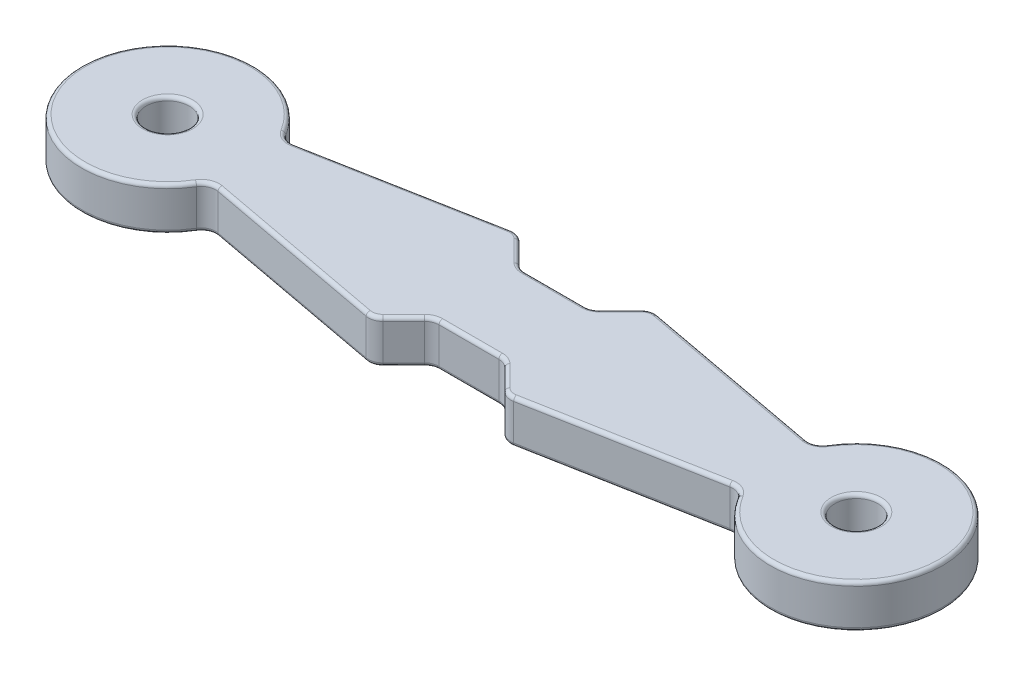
from build123d import *

# Parameters (mm, degrees)
SKIZZE1_R                       = 1.5
AUFSATZ_LINEAR_AUSTRAGEN1_DEPTH = 3
VERRUNDUNG1_R                   = 1
VERRUNDUNG2_R                   = 0.25


with BuildPart() as part:
    # Skizze1 → Aufsatz-Linear austragen1 (new body)
    with BuildSketch(Plane(origin=(0, 0, 0), x_dir=(1, 0, 0), z_dir=(0, 1, 0))):
        with BuildLine():
            Line((26.5, 3), (21.5, 3))
            Line((21.5, 3), (19.378679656, 5.121320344))
            Line((19.378679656, 5.121320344), (5.4459606, 2.518236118))
            ThreePointArc((5.4459606, 2.518236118), (-6, 0), (5.4459606, -2.518236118))
            Line((5.4459606, -2.518236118), (19.378679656, -5.121320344))
            Line((19.378679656, -5.121320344), (21.5, -3))
            Line((21.5, -3), (26.5, -3))
            Line((26.5, -3), (28.621320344, -5.121320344))
            Line((28.621320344, -5.121320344), (42.5540394, -2.518236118))
            ThreePointArc((42.5540394, -2.518236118), (54, 0), (42.5540394, 2.518236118))
            Line((42.5540394, 2.518236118), (28.621320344, 5.121320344))
            Line((28.621320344, 5.121320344), (26.5, 3))
        make_face()
        with Locations(Location((0, 0, 0), (0, 0, 270))):
            Circle(SKIZZE1_R, mode=Mode.SUBTRACT)
        with Locations(Location((48, 0, 0), (0, 0, 90))):
            Circle(SKIZZE1_R, mode=Mode.SUBTRACT)
    extrude(amount=AUFSATZ_LINEAR_AUSTRAGEN1_DEPTH)

    # Verrundung1
    verrundung1_edges = [part.edges().sort_by_distance(p)[0] for p in [
        (28.621320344, 1.5, -5.121320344),
        (42.5540394, 1.5, -2.518236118),
        (42.5540394, 1.5, 2.518236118),
        (28.621320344, 1.5, 5.121320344),
        (26.5, 1.5, 3),
        (21.5, 1.5, 3),
        (19.378679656, 1.5, 5.121320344),
        (5.4459606, 1.5, 2.518236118),
        (5.4459606, 1.5, -2.518236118),
        (19.378679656, 1.5, -5.121320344),
        (21.5, 1.5, -3),
        (26.5, 1.5, -3),
    ]]
    fillet(verrundung1_edges, radius=VERRUNDUNG1_R)

    # Verrundung2
    verrundung2_edges = [part.edges().sort_by_distance(p)[0] for p in [
        (0, 0, -1.5),
        (0, 3, -1.5),
        (48, 0, 1.5),
        (48, 3, 1.5),
        (27.520767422, 0, -4.020767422),
        (27.520767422, 3, -4.020767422),
        (35.48697027, 0, -3.838594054),
        (54, 0, 0),
        (35.48697027, 0, 3.838594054),
        (27.520767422, 0, 4.020767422),
        (24, 0, 3),
        (20.479232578, 0, 4.020767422),
        (12.51302973, 0, 3.838594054),
        (-6, 0, 0),
        (12.51302973, 0, -3.838594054),
        (20.479232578, 0, -4.020767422),
        (24, 0, -3),
        (19.340103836, 0, -4.99676856),
        (19.340103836, 0, 4.99676856),
        (28.659896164, 0, 4.99676856),
        (28.659896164, 0, -4.99676856),
        (35.48697027, 3, -3.838594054),
        (24, 3, -3),
        (20.479232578, 3, -4.020767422),
        (12.51302973, 3, -3.838594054),
        (-6, 3, 0),
        (12.51302973, 3, 3.838594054),
        (20.479232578, 3, 4.020767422),
        (24, 3, 3),
        (27.520767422, 3, 4.020767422),
        (35.48697027, 3, 3.838594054),
        (54, 3, 0),
        (19.340103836, 3, -4.99676856),
        (19.340103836, 3, 4.99676856),
        (28.659896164, 3, 4.99676856),
        (28.659896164, 3, -4.99676856),
        (42.42593852, 0, -2.722558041),
        (42.42593852, 3, -2.722558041),
        (42.42593852, 0, 2.722558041),
        (42.42593852, 3, 2.722558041),
        (26.46846987, 0, 3.076120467),
        (26.46846987, 3, 3.076120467),
        (5.57406148, 0, 2.722558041),
        (5.57406148, 3, 2.722558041),
        (5.57406148, 0, -2.722558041),
        (5.57406148, 3, -2.722558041),
        (21.53153013, 0, -3.076120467),
        (21.53153013, 3, -3.076120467),
        (26.46846987, 0, -3.076120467),
        (26.46846987, 3, -3.076120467),
        (21.53153013, 0, 3.076120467),
        (21.53153013, 3, 3.076120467),
    ]]
    fillet(verrundung2_edges, radius=VERRUNDUNG2_R)


solid = part.part
